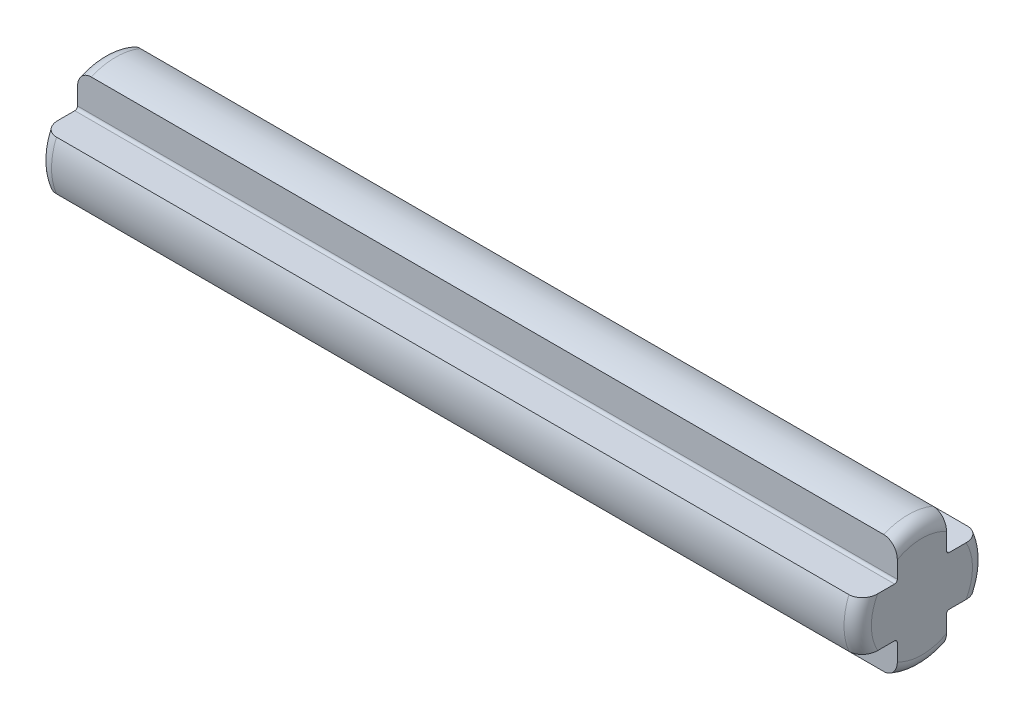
from build123d import *

# Parameters (mm, degrees)
EXTRUIR1_DEPTH = 15
REDONDEO1_R    = 0.5


with BuildPart() as part:
    # Croquis1 → Extruir1 (new, symmetric)
    with BuildSketch(Plane(origin=(0, 0, 0), x_dir=(0, 0, -1), z_dir=(1, 0, 0))):
        with BuildLine():
            Line((-0.9, 2.170829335), (-0.9, 1))
            ThreePointArc((-0.9, 1), (-0.929289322, 0.929289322), (-1, 0.9))
            Line((-1, 0.9), (-2.170829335, 0.9))
            ThreePointArc((-2.170829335, 0.9), (-2.35, 0), (-2.170829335, -0.9))
            Line((-2.170829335, -0.9), (-1, -0.9))
            ThreePointArc((-1, -0.9), (-0.929289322, -0.929289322), (-0.9, -1))
            Line((-0.9, -1), (-0.9, -2.170829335))
            ThreePointArc((-0.9, -2.170829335), (0, -2.35), (0.9, -2.170829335))
            Line((0.9, -2.170829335), (0.9, -1))
            ThreePointArc((0.9, -1), (0.929289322, -0.929289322), (1, -0.9))
            Line((1, -0.9), (2.170829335, -0.9))
            ThreePointArc((2.170829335, -0.9), (2.35, 0), (2.170829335, 0.9))
            Line((2.170829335, 0.9), (1, 0.9))
            ThreePointArc((1, 0.9), (0.929289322, 0.929289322), (0.9, 1))
            Line((0.9, 1), (0.9, 2.170829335))
            ThreePointArc((0.9, 2.170829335), (0, 2.35), (-0.9, 2.170829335))
        make_face()
    extrude(amount=EXTRUIR1_DEPTH, both=True)

    # Redondeo1
    redondeo1_edges = [part.edges().sort_by_distance(p)[0] for p in [
        (-15, 2.35, 0),
        (15, -2.35, 0),
        (-15, 0, -2.35),
        (-15, -2.35, 0),
        (-15, 0, 2.35),
        (15, 0, -2.35),
        (15, 0, 2.35),
        (15, 2.35, 0),
    ]]
    fillet(redondeo1_edges, radius=REDONDEO1_R)


solid = part.part
